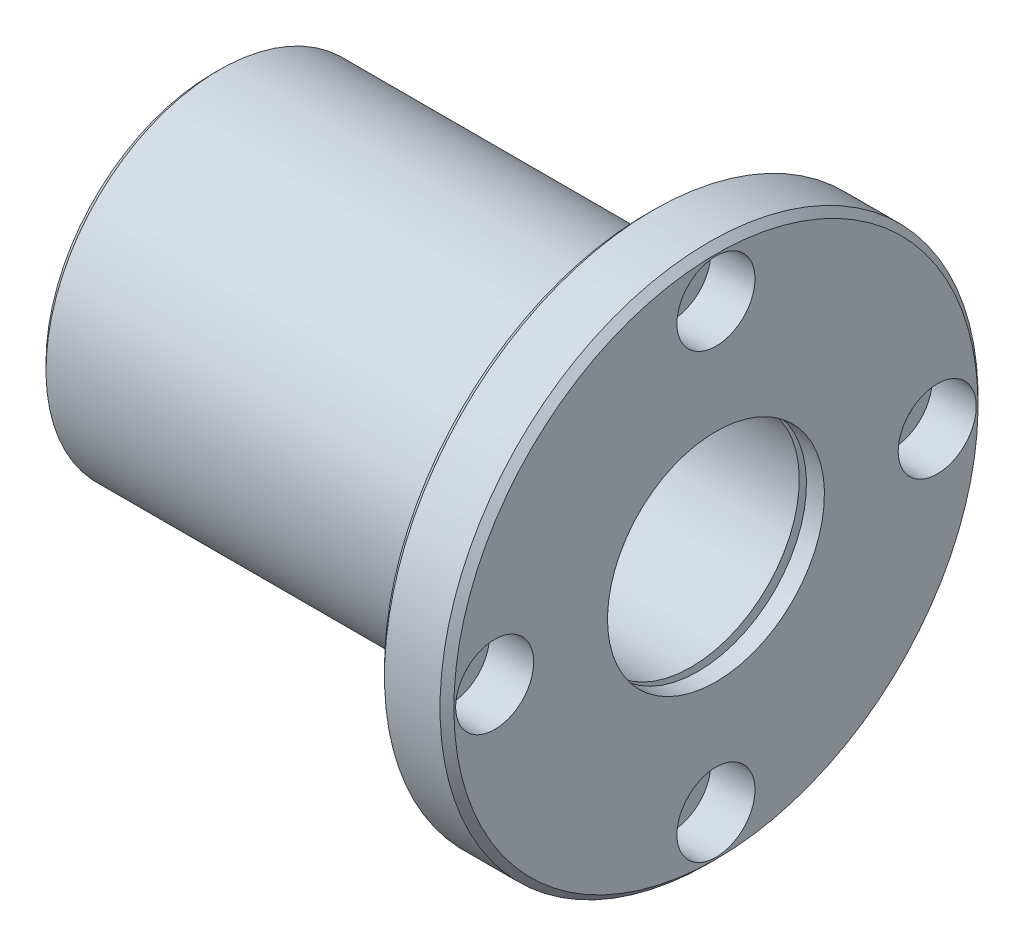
ISO-10303-21;
HEADER;
FILE_DESCRIPTION(('STEP AP214'),'2;1');
FILE_NAME('part.step','',(''),(''),'','','');
FILE_SCHEMA(('AUTOMOTIVE_DESIGN { 1 0 10303 214 1 1 1 1 }'));
ENDSEC;
DATA;
#1=APPLICATION_CONTEXT('core data for automotive mechanical design processes');
#2=APPLICATION_PROTOCOL_DEFINITION('international standard','automotive_design',2000,#1);
#3=PRODUCT_CONTEXT('',#1,'mechanical');
#4=PRODUCT('Part','Part','',(#3));
#5=PRODUCT_RELATED_PRODUCT_CATEGORY('part','',(#4));
#6=PRODUCT_DEFINITION_FORMATION('','',#4);
#7=PRODUCT_DEFINITION_CONTEXT('part definition',#1,'design');
#8=PRODUCT_DEFINITION('design','',#6,#7);
#9=PRODUCT_DEFINITION_SHAPE('','',#8);
#10=(LENGTH_UNIT() NAMED_UNIT(*) SI_UNIT(.MILLI.,.METRE.));
#11=(NAMED_UNIT(*) PLANE_ANGLE_UNIT() SI_UNIT($,.RADIAN.));
#12=(NAMED_UNIT(*) SI_UNIT($,.STERADIAN.) SOLID_ANGLE_UNIT());
#13=UNCERTAINTY_MEASURE_WITH_UNIT(LENGTH_MEASURE(1.E-05),#10,'distance_accuracy_value','');
#14=(GEOMETRIC_REPRESENTATION_CONTEXT(3) GLOBAL_UNCERTAINTY_ASSIGNED_CONTEXT((#13)) GLOBAL_UNIT_ASSIGNED_CONTEXT((#10,
#11,#12)) REPRESENTATION_CONTEXT('',''));
#15=CARTESIAN_POINT('',(0.,0.,0.));
#16=DIRECTION('',(0.,0.,1.));
#17=DIRECTION('',(1.,0.,0.));
#18=AXIS2_PLACEMENT_3D('',#15,#16,#17);
#19=CARTESIAN_POINT('',(0.,16.225,0.));
#20=DIRECTION('',(-1.,0.,0.));
#21=DIRECTION('',(0.,0.,1.));
#22=AXIS2_PLACEMENT_3D('',#19,#20,#21);
#23=PLANE('',#22);
#24=CARTESIAN_POINT('',(0.,0.,0.));
#25=DIRECTION('',(-1.,0.,0.));
#26=DIRECTION('',(0.,1.,0.));
#27=AXIS2_PLACEMENT_3D('',#24,#25,#26);
#28=CIRCLE('',#27,13.25);
#29=CARTESIAN_POINT('',(0.,-13.25,0.));
#30=VERTEX_POINT('',#29);
#31=EDGE_CURVE('E252',#30,#30,#28,.T.);
#32=ORIENTED_EDGE('',*,*,#31,.F.);
#33=EDGE_LOOP('',(#32));
#34=FACE_BOUND('',#33,.T.);
#35=CARTESIAN_POINT('',(0.,0.,0.));
#36=DIRECTION('',(-1.,0.,0.));
#37=DIRECTION('',(0.,1.,0.));
#38=AXIS2_PLACEMENT_3D('',#35,#36,#37);
#39=CIRCLE('',#38,19.2);
#40=CARTESIAN_POINT('',(0.,-19.2,0.));
#41=VERTEX_POINT('',#40);
#42=EDGE_CURVE('E245',#41,#41,#39,.T.);
#43=ORIENTED_EDGE('',*,*,#42,.T.);
#44=EDGE_LOOP('',(#43));
#45=FACE_BOUND('',#44,.T.);
#46=ADVANCED_FACE('F16',(#34,#45),#23,.T.);
#47=CARTESIAN_POINT('',(50.,25.175630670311,0.));
#48=DIRECTION('',(-1.,0.,0.));
#49=DIRECTION('',(0.,0.,1.));
#50=AXIS2_PLACEMENT_3D('',#47,#48,#49);
#51=PLANE('',#50);
#52=CARTESIAN_POINT('',(50.,0.,0.));
#53=DIRECTION('',(-1.,0.,0.));
#54=DIRECTION('',(0.,1.,0.));
#55=AXIS2_PLACEMENT_3D('',#52,#53,#54);
#56=CIRCLE('',#55,20.1512613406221);
#57=CARTESIAN_POINT('',(50.,20.1512613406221,0.));
#58=VERTEX_POINT('',#57);
#59=CARTESIAN_POINT('',(50.,0.,-20.1512613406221));
#60=VERTEX_POINT('',#59);
#61=EDGE_CURVE('E244',#58,#60,#56,.T.);
#62=ORIENTED_EDGE('',*,*,#61,.F.);
#63=CARTESIAN_POINT('',(50.,0.,0.));
#64=DIRECTION('',(-1.,0.,0.));
#65=DIRECTION('',(0.,1.,0.));
#66=AXIS2_PLACEMENT_3D('',#63,#64,#65);
#67=CIRCLE('',#66,20.1512613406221);
#68=EDGE_CURVE('E224',#60,#58,#67,.T.);
#69=ORIENTED_EDGE('',*,*,#68,.F.);
#70=EDGE_LOOP('',(#62,#69));
#71=FACE_BOUND('',#70,.T.);
#72=CARTESIAN_POINT('',(50.,25.5,0.));
#73=DIRECTION('',(1.,0.,0.));
#74=DIRECTION('',(0.,1.,0.));
#75=AXIS2_PLACEMENT_3D('',#72,#73,#74);
#76=CIRCLE('',#75,2.75);
#77=CARTESIAN_POINT('',(50.,22.75,0.));
#78=VERTEX_POINT('',#77);
#79=EDGE_CURVE('E234',#78,#78,#76,.T.);
#80=ORIENTED_EDGE('',*,*,#79,.T.);
#81=EDGE_LOOP('',(#80));
#82=FACE_BOUND('',#81,.T.);
#83=CARTESIAN_POINT('',(50.,-25.5,0.));
#84=DIRECTION('',(1.,0.,0.));
#85=DIRECTION('',(0.,1.,0.));
#86=AXIS2_PLACEMENT_3D('',#83,#84,#85);
#87=CIRCLE('',#86,2.75);
#88=CARTESIAN_POINT('',(50.,-28.25,0.));
#89=VERTEX_POINT('',#88);
#90=EDGE_CURVE('E303',#89,#89,#87,.T.);
#91=ORIENTED_EDGE('',*,*,#90,.T.);
#92=EDGE_LOOP('',(#91));
#93=FACE_BOUND('',#92,.T.);
#94=CARTESIAN_POINT('',(50.,0.,25.5));
#95=DIRECTION('',(1.,0.,0.));
#96=DIRECTION('',(0.,0.,-1.));
#97=AXIS2_PLACEMENT_3D('',#94,#95,#96);
#98=CIRCLE('',#97,2.75);
#99=CARTESIAN_POINT('',(50.,0.,28.25));
#100=VERTEX_POINT('',#99);
#101=EDGE_CURVE('E276',#100,#100,#98,.T.);
#102=ORIENTED_EDGE('',*,*,#101,.T.);
#103=EDGE_LOOP('',(#102));
#104=FACE_BOUND('',#103,.T.);
#105=CARTESIAN_POINT('',(50.,0.,-25.5));
#106=DIRECTION('',(1.,0.,0.));
#107=DIRECTION('',(0.,0.,-1.));
#108=AXIS2_PLACEMENT_3D('',#105,#106,#107);
#109=CIRCLE('',#108,2.75);
#110=CARTESIAN_POINT('',(50.,0.,-22.75));
#111=VERTEX_POINT('',#110);
#112=EDGE_CURVE('E355',#111,#111,#109,.T.);
#113=ORIENTED_EDGE('',*,*,#112,.T.);
#114=EDGE_LOOP('',(#113));
#115=FACE_BOUND('',#114,.T.);
#116=CARTESIAN_POINT('',(50.,0.,0.));
#117=DIRECTION('',(-1.,0.,0.));
#118=DIRECTION('',(0.,1.,0.));
#119=AXIS2_PLACEMENT_3D('',#116,#117,#118);
#120=CIRCLE('',#119,30.2);
#121=CARTESIAN_POINT('',(50.,-30.2,0.));
#122=VERTEX_POINT('',#121);
#123=EDGE_CURVE('E260',#122,#122,#120,.T.);
#124=ORIENTED_EDGE('',*,*,#123,.T.);
#125=EDGE_LOOP('',(#124));
#126=FACE_BOUND('',#125,.T.);
#127=ADVANCED_FACE('F18',(#71,#82,#93,#104,#115,#126),#51,.T.);
#128=CARTESIAN_POINT('',(58.,21.35,0.));
#129=DIRECTION('',(1.,0.,0.));
#130=DIRECTION('',(0.,1.,0.));
#131=AXIS2_PLACEMENT_3D('',#128,#129,#130);
#132=PLANE('',#131);
#133=CARTESIAN_POINT('',(58.,25.5,0.));
#134=DIRECTION('',(-1.,0.,0.));
#135=DIRECTION('',(0.,1.,0.));
#136=AXIS2_PLACEMENT_3D('',#133,#134,#135);
#137=CIRCLE('',#136,4.5);
#138=CARTESIAN_POINT('',(58.,21.,0.));
#139=VERTEX_POINT('',#138);
#140=EDGE_CURVE('E300',#139,#139,#137,.T.);
#141=ORIENTED_EDGE('',*,*,#140,.T.);
#142=EDGE_LOOP('',(#141));
#143=FACE_BOUND('',#142,.T.);
#144=CARTESIAN_POINT('',(58.,-25.5,0.));
#145=DIRECTION('',(-1.,0.,0.));
#146=DIRECTION('',(0.,1.,0.));
#147=AXIS2_PLACEMENT_3D('',#144,#145,#146);
#148=CIRCLE('',#147,4.5);
#149=CARTESIAN_POINT('',(58.,-30.,0.));
#150=VERTEX_POINT('',#149);
#151=EDGE_CURVE('E280',#150,#150,#148,.T.);
#152=ORIENTED_EDGE('',*,*,#151,.T.);
#153=EDGE_LOOP('',(#152));
#154=FACE_BOUND('',#153,.T.);
#155=CARTESIAN_POINT('',(58.,0.,25.5));
#156=DIRECTION('',(-1.,0.,0.));
#157=DIRECTION('',(0.,0.,-1.));
#158=AXIS2_PLACEMENT_3D('',#155,#156,#157);
#159=CIRCLE('',#158,4.5);
#160=CARTESIAN_POINT('',(58.,0.,30.));
#161=VERTEX_POINT('',#160);
#162=EDGE_CURVE('E352',#161,#161,#159,.T.);
#163=ORIENTED_EDGE('',*,*,#162,.T.);
#164=EDGE_LOOP('',(#163));
#165=FACE_BOUND('',#164,.T.);
#166=CARTESIAN_POINT('',(58.,0.,-25.5));
#167=DIRECTION('',(-1.,0.,0.));
#168=DIRECTION('',(0.,0.,-1.));
#169=AXIS2_PLACEMENT_3D('',#166,#167,#168);
#170=CIRCLE('',#169,4.5);
#171=CARTESIAN_POINT('',(58.,0.,-21.));
#172=VERTEX_POINT('',#171);
#173=EDGE_CURVE('E10',#172,#172,#170,.T.);
#174=ORIENTED_EDGE('',*,*,#173,.T.);
#175=EDGE_LOOP('',(#174));
#176=FACE_BOUND('',#175,.T.);
#177=CARTESIAN_POINT('',(58.,0.,0.));
#178=DIRECTION('',(-1.,0.,0.));
#179=DIRECTION('',(0.,1.,0.));
#180=AXIS2_PLACEMENT_3D('',#177,#178,#179);
#181=CIRCLE('',#180,12.5);
#182=CARTESIAN_POINT('',(58.,-12.5,0.));
#183=VERTEX_POINT('',#182);
#184=EDGE_CURVE('E210',#183,#183,#181,.T.);
#185=ORIENTED_EDGE('',*,*,#184,.T.);
#186=EDGE_LOOP('',(#185));
#187=FACE_BOUND('',#186,.T.);
#188=CARTESIAN_POINT('',(58.,0.,0.));
#189=DIRECTION('',(-1.,0.,0.));
#190=DIRECTION('',(0.,1.,0.));
#191=AXIS2_PLACEMENT_3D('',#188,#189,#190);
#192=CIRCLE('',#191,30.2);
#193=CARTESIAN_POINT('',(58.,-30.2,0.));
#194=VERTEX_POINT('',#193);
#195=EDGE_CURVE('E296',#194,#194,#192,.T.);
#196=ORIENTED_EDGE('',*,*,#195,.F.);
#197=EDGE_LOOP('',(#196));
#198=FACE_BOUND('',#197,.T.);
#199=ADVANCED_FACE('F418',(#143,#154,#165,#176,#187,#198),#132,.T.);
#200=CARTESIAN_POINT('',(55.9285714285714,13.5,0.));
#201=DIRECTION('',(-1.,0.,0.));
#202=DIRECTION('',(0.,0.,1.));
#203=AXIS2_PLACEMENT_3D('',#200,#201,#202);
#204=PLANE('',#203);
#205=CARTESIAN_POINT('',(55.9285714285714,0.,0.));
#206=DIRECTION('',(-1.,0.,0.));
#207=DIRECTION('',(0.,1.,0.));
#208=AXIS2_PLACEMENT_3D('',#205,#206,#207);
#209=CIRCLE('',#208,12.5);
#210=CARTESIAN_POINT('',(55.9285714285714,-12.5,0.));
#211=VERTEX_POINT('',#210);
#212=EDGE_CURVE('E299',#211,#211,#209,.T.);
#213=ORIENTED_EDGE('',*,*,#212,.F.);
#214=EDGE_LOOP('',(#213));
#215=FACE_BOUND('',#214,.T.);
#216=CARTESIAN_POINT('',(55.9285714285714,0.,0.));
#217=DIRECTION('',(-1.,0.,0.));
#218=DIRECTION('',(0.,1.,0.));
#219=AXIS2_PLACEMENT_3D('',#216,#217,#218);
#220=CIRCLE('',#219,14.5);
#221=CARTESIAN_POINT('',(55.9285714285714,-14.5,0.));
#222=VERTEX_POINT('',#221);
#223=EDGE_CURVE('E331',#222,#222,#220,.T.);
#224=ORIENTED_EDGE('',*,*,#223,.T.);
#225=EDGE_LOOP('',(#224));
#226=FACE_BOUND('',#225,.T.);
#227=ADVANCED_FACE('F464',(#215,#226),#204,.T.);
#228=CARTESIAN_POINT('',(55.1,13.5,0.));
#229=DIRECTION('',(1.,0.,0.));
#230=DIRECTION('',(0.,1.,0.));
#231=AXIS2_PLACEMENT_3D('',#228,#229,#230);
#232=PLANE('',#231);
#233=CARTESIAN_POINT('',(55.1,0.,0.));
#234=DIRECTION('',(-1.,0.,0.));
#235=DIRECTION('',(0.,1.,0.));
#236=AXIS2_PLACEMENT_3D('',#233,#234,#235);
#237=CIRCLE('',#236,12.5);
#238=CARTESIAN_POINT('',(55.1,-12.5,0.));
#239=VERTEX_POINT('',#238);
#240=EDGE_CURVE('E326',#239,#239,#237,.T.);
#241=ORIENTED_EDGE('',*,*,#240,.T.);
#242=EDGE_LOOP('',(#241));
#243=FACE_BOUND('',#242,.T.);
#244=CARTESIAN_POINT('',(55.1,0.,0.));
#245=DIRECTION('',(-1.,0.,0.));
#246=DIRECTION('',(0.,1.,0.));
#247=AXIS2_PLACEMENT_3D('',#244,#245,#246);
#248=CIRCLE('',#247,14.5);
#249=CARTESIAN_POINT('',(55.1,-14.5,0.));
#250=VERTEX_POINT('',#249);
#251=EDGE_CURVE('E314',#250,#250,#248,.T.);
#252=ORIENTED_EDGE('',*,*,#251,.F.);
#253=EDGE_LOOP('',(#252));
#254=FACE_BOUND('',#253,.T.);
#255=ADVANCED_FACE('F469',(#243,#254),#232,.T.);
#256=CARTESIAN_POINT('',(2.9,13.5,0.));
#257=DIRECTION('',(-1.,0.,0.));
#258=DIRECTION('',(0.,0.,1.));
#259=AXIS2_PLACEMENT_3D('',#256,#257,#258);
#260=PLANE('',#259);
#261=CARTESIAN_POINT('',(2.9,0.,0.));
#262=DIRECTION('',(-1.,0.,0.));
#263=DIRECTION('',(0.,1.,0.));
#264=AXIS2_PLACEMENT_3D('',#261,#262,#263);
#265=CIRCLE('',#264,12.5);
#266=CARTESIAN_POINT('',(2.9,-12.5,0.));
#267=VERTEX_POINT('',#266);
#268=EDGE_CURVE('E327',#267,#267,#265,.T.);
#269=ORIENTED_EDGE('',*,*,#268,.F.);
#270=EDGE_LOOP('',(#269));
#271=FACE_BOUND('',#270,.T.);
#272=CARTESIAN_POINT('',(2.9,0.,0.));
#273=DIRECTION('',(-1.,0.,0.));
#274=DIRECTION('',(0.,1.,0.));
#275=AXIS2_PLACEMENT_3D('',#272,#273,#274);
#276=CIRCLE('',#275,14.5);
#277=CARTESIAN_POINT('',(2.9,-14.5,0.));
#278=VERTEX_POINT('',#277);
#279=EDGE_CURVE('E249',#278,#278,#276,.T.);
#280=ORIENTED_EDGE('',*,*,#279,.T.);
#281=EDGE_LOOP('',(#280));
#282=FACE_BOUND('',#281,.T.);
#283=ADVANCED_FACE('F476',(#271,#282),#260,.T.);
#284=CARTESIAN_POINT('',(2.07142857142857,13.875,0.));
#285=DIRECTION('',(1.,0.,0.));
#286=DIRECTION('',(0.,1.,0.));
#287=AXIS2_PLACEMENT_3D('',#284,#285,#286);
#288=PLANE('',#287);
#289=CARTESIAN_POINT('',(2.07142857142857,0.,0.));
#290=DIRECTION('',(-1.,0.,0.));
#291=DIRECTION('',(0.,1.,0.));
#292=AXIS2_PLACEMENT_3D('',#289,#290,#291);
#293=CIRCLE('',#292,13.25);
#294=CARTESIAN_POINT('',(2.07142857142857,-13.25,0.));
#295=VERTEX_POINT('',#294);
#296=EDGE_CURVE('E231',#295,#295,#293,.T.);
#297=ORIENTED_EDGE('',*,*,#296,.T.);
#298=EDGE_LOOP('',(#297));
#299=FACE_BOUND('',#298,.T.);
#300=CARTESIAN_POINT('',(2.07142857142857,0.,0.));
#301=DIRECTION('',(-1.,0.,0.));
#302=DIRECTION('',(0.,1.,0.));
#303=AXIS2_PLACEMENT_3D('',#300,#301,#302);
#304=CIRCLE('',#303,14.5);
#305=CARTESIAN_POINT('',(2.07142857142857,-14.5,0.));
#306=VERTEX_POINT('',#305);
#307=EDGE_CURVE('E342',#306,#306,#304,.T.);
#308=ORIENTED_EDGE('',*,*,#307,.F.);
#309=EDGE_LOOP('',(#308));
#310=FACE_BOUND('',#309,.T.);
#311=ADVANCED_FACE('F478',(#299,#310),#288,.T.);
#312=CARTESIAN_POINT('',(52.9,29.125,0.));
#313=DIRECTION('',(-1.,0.,0.));
#314=DIRECTION('',(0.,0.,1.));
#315=AXIS2_PLACEMENT_3D('',#312,#313,#314);
#316=PLANE('',#315);
#317=CARTESIAN_POINT('',(52.9,25.5,0.));
#318=DIRECTION('',(-1.,0.,0.));
#319=DIRECTION('',(0.,1.,0.));
#320=AXIS2_PLACEMENT_3D('',#317,#318,#319);
#321=CIRCLE('',#320,2.75);
#322=CARTESIAN_POINT('',(52.9,22.75,0.));
#323=VERTEX_POINT('',#322);
#324=EDGE_CURVE('E230',#323,#323,#321,.T.);
#325=ORIENTED_EDGE('',*,*,#324,.T.);
#326=EDGE_LOOP('',(#325));
#327=FACE_BOUND('',#326,.T.);
#328=CARTESIAN_POINT('',(52.9,25.5,0.));
#329=DIRECTION('',(-1.,0.,0.));
#330=DIRECTION('',(0.,1.,0.));
#331=AXIS2_PLACEMENT_3D('',#328,#329,#330);
#332=CIRCLE('',#331,4.5);
#333=CARTESIAN_POINT('',(52.9,21.,0.));
#334=VERTEX_POINT('',#333);
#335=EDGE_CURVE('E225',#334,#334,#332,.T.);
#336=ORIENTED_EDGE('',*,*,#335,.F.);
#337=EDGE_LOOP('',(#336));
#338=FACE_BOUND('',#337,.T.);
#339=ADVANCED_FACE('F481',(#327,#338),#316,.F.);
#340=CARTESIAN_POINT('',(52.9,-21.875,0.));
#341=DIRECTION('',(-1.,0.,0.));
#342=DIRECTION('',(0.,0.,1.));
#343=AXIS2_PLACEMENT_3D('',#340,#341,#342);
#344=PLANE('',#343);
#345=CARTESIAN_POINT('',(52.9,-25.5,0.));
#346=DIRECTION('',(-1.,0.,0.));
#347=DIRECTION('',(0.,1.,0.));
#348=AXIS2_PLACEMENT_3D('',#345,#346,#347);
#349=CIRCLE('',#348,2.75);
#350=CARTESIAN_POINT('',(52.9,-28.25,0.));
#351=VERTEX_POINT('',#350);
#352=EDGE_CURVE('E221',#351,#351,#349,.T.);
#353=ORIENTED_EDGE('',*,*,#352,.T.);
#354=EDGE_LOOP('',(#353));
#355=FACE_BOUND('',#354,.T.);
#356=CARTESIAN_POINT('',(52.9,-25.5,0.));
#357=DIRECTION('',(-1.,0.,0.));
#358=DIRECTION('',(0.,1.,0.));
#359=AXIS2_PLACEMENT_3D('',#356,#357,#358);
#360=CIRCLE('',#359,4.5);
#361=CARTESIAN_POINT('',(52.9,-30.,0.));
#362=VERTEX_POINT('',#361);
#363=EDGE_CURVE('E216',#362,#362,#360,.T.);
#364=ORIENTED_EDGE('',*,*,#363,.F.);
#365=EDGE_LOOP('',(#364));
#366=FACE_BOUND('',#365,.T.);
#367=ADVANCED_FACE('F409',(#355,#366),#344,.F.);
#368=CARTESIAN_POINT('',(52.9,0.,21.875));
#369=DIRECTION('',(-1.,0.,0.));
#370=DIRECTION('',(0.,0.,1.));
#371=AXIS2_PLACEMENT_3D('',#368,#369,#370);
#372=PLANE('',#371);
#373=CARTESIAN_POINT('',(52.9,0.,25.5));
#374=DIRECTION('',(-1.,0.,0.));
#375=DIRECTION('',(0.,0.,-1.));
#376=AXIS2_PLACEMENT_3D('',#373,#374,#375);
#377=CIRCLE('',#376,2.75);
#378=CARTESIAN_POINT('',(52.9,0.,28.25));
#379=VERTEX_POINT('',#378);
#380=EDGE_CURVE('E264',#379,#379,#377,.T.);
#381=ORIENTED_EDGE('',*,*,#380,.T.);
#382=EDGE_LOOP('',(#381));
#383=FACE_BOUND('',#382,.T.);
#384=CARTESIAN_POINT('',(52.9,0.,25.5));
#385=DIRECTION('',(-1.,0.,0.));
#386=DIRECTION('',(0.,0.,-1.));
#387=AXIS2_PLACEMENT_3D('',#384,#385,#386);
#388=CIRCLE('',#387,4.5);
#389=CARTESIAN_POINT('',(52.9,0.,30.));
#390=VERTEX_POINT('',#389);
#391=EDGE_CURVE('E267',#390,#390,#388,.T.);
#392=ORIENTED_EDGE('',*,*,#391,.F.);
#393=EDGE_LOOP('',(#392));
#394=FACE_BOUND('',#393,.T.);
#395=ADVANCED_FACE('F399',(#383,#394),#372,.F.);
#396=CARTESIAN_POINT('',(52.9,0.,-29.125));
#397=DIRECTION('',(-1.,0.,0.));
#398=DIRECTION('',(0.,0.,1.));
#399=AXIS2_PLACEMENT_3D('',#396,#397,#398);
#400=PLANE('',#399);
#401=CARTESIAN_POINT('',(52.9,0.,-25.5));
#402=DIRECTION('',(-1.,0.,0.));
#403=DIRECTION('',(0.,0.,-1.));
#404=AXIS2_PLACEMENT_3D('',#401,#402,#403);
#405=CIRCLE('',#404,2.75);
#406=CARTESIAN_POINT('',(52.9,0.,-22.75));
#407=VERTEX_POINT('',#406);
#408=EDGE_CURVE('E363',#407,#407,#405,.T.);
#409=ORIENTED_EDGE('',*,*,#408,.T.);
#410=EDGE_LOOP('',(#409));
#411=FACE_BOUND('',#410,.T.);
#412=CARTESIAN_POINT('',(52.9,0.,-25.5));
#413=DIRECTION('',(-1.,0.,0.));
#414=DIRECTION('',(0.,0.,-1.));
#415=AXIS2_PLACEMENT_3D('',#412,#413,#414);
#416=CIRCLE('',#415,4.5);
#417=CARTESIAN_POINT('',(52.9,0.,-21.));
#418=VERTEX_POINT('',#417);
#419=EDGE_CURVE('E360',#418,#418,#416,.T.);
#420=ORIENTED_EDGE('',*,*,#419,.F.);
#421=EDGE_LOOP('',(#420));
#422=FACE_BOUND('',#421,.T.);
#423=ADVANCED_FACE('F397',(#411,#422),#400,.F.);
#424=CARTESIAN_POINT('',(55.45,0.,-25.5));
#425=DIRECTION('',(1.,0.,0.));
#426=DIRECTION('',(0.,0.,-1.));
#427=AXIS2_PLACEMENT_3D('',#424,#425,#426);
#428=CYLINDRICAL_SURFACE('',#427,4.5);
#429=ORIENTED_EDGE('',*,*,#419,.T.);
#430=DIRECTION('',(1.,0.,0.));
#431=VECTOR('',#430,1.);
#432=CARTESIAN_POINT('',(55.45,0.,-21.));
#433=LINE('',#432,#431);
#434=EDGE_CURVE('E25',#418,#172,#433,.T.);
#435=ORIENTED_EDGE('',*,*,#434,.T.);
#436=ORIENTED_EDGE('',*,*,#173,.F.);
#437=ORIENTED_EDGE('',*,*,#434,.F.);
#438=EDGE_LOOP('',(#429,#435,#436,#437));
#439=FACE_BOUND('',#438,.T.);
#440=ADVANCED_FACE('F394',(#439),#428,.F.);
#441=CARTESIAN_POINT('',(51.45,0.,-25.5));
#442=DIRECTION('',(1.,0.,0.));
#443=DIRECTION('',(0.,0.,-1.));
#444=AXIS2_PLACEMENT_3D('',#441,#442,#443);
#445=CYLINDRICAL_SURFACE('',#444,2.75);
#446=ORIENTED_EDGE('',*,*,#112,.F.);
#447=DIRECTION('',(1.,0.,0.));
#448=VECTOR('',#447,1.);
#449=CARTESIAN_POINT('',(51.45,0.,-22.75));
#450=LINE('',#449,#448);
#451=EDGE_CURVE('E386',#111,#407,#450,.T.);
#452=ORIENTED_EDGE('',*,*,#451,.T.);
#453=ORIENTED_EDGE('',*,*,#408,.F.);
#454=ORIENTED_EDGE('',*,*,#451,.F.);
#455=EDGE_LOOP('',(#446,#452,#453,#454));
#456=FACE_BOUND('',#455,.T.);
#457=ADVANCED_FACE('F407',(#456),#445,.F.);
#458=CARTESIAN_POINT('',(55.45,0.,25.5));
#459=DIRECTION('',(1.,0.,0.));
#460=DIRECTION('',(0.,0.,-1.));
#461=AXIS2_PLACEMENT_3D('',#458,#459,#460);
#462=CYLINDRICAL_SURFACE('',#461,4.5);
#463=ORIENTED_EDGE('',*,*,#391,.T.);
#464=DIRECTION('',(1.,0.,0.));
#465=VECTOR('',#464,1.);
#466=CARTESIAN_POINT('',(55.45,0.,30.));
#467=LINE('',#466,#465);
#468=EDGE_CURVE('E356',#390,#161,#467,.T.);
#469=ORIENTED_EDGE('',*,*,#468,.T.);
#470=ORIENTED_EDGE('',*,*,#162,.F.);
#471=ORIENTED_EDGE('',*,*,#468,.F.);
#472=EDGE_LOOP('',(#463,#469,#470,#471));
#473=FACE_BOUND('',#472,.T.);
#474=ADVANCED_FACE('F437',(#473),#462,.F.);
#475=CARTESIAN_POINT('',(51.45,0.,25.5));
#476=DIRECTION('',(1.,0.,0.));
#477=DIRECTION('',(0.,0.,-1.));
#478=AXIS2_PLACEMENT_3D('',#475,#476,#477);
#479=CYLINDRICAL_SURFACE('',#478,2.75);
#480=ORIENTED_EDGE('',*,*,#101,.F.);
#481=DIRECTION('',(1.,0.,0.));
#482=VECTOR('',#481,1.);
#483=CARTESIAN_POINT('',(51.45,0.,28.25));
#484=LINE('',#483,#482);
#485=EDGE_CURVE('E268',#100,#379,#484,.T.);
#486=ORIENTED_EDGE('',*,*,#485,.T.);
#487=ORIENTED_EDGE('',*,*,#380,.F.);
#488=ORIENTED_EDGE('',*,*,#485,.F.);
#489=EDGE_LOOP('',(#480,#486,#487,#488));
#490=FACE_BOUND('',#489,.T.);
#491=ADVANCED_FACE('F433',(#490),#479,.F.);
#492=CARTESIAN_POINT('',(55.45,-25.5,0.));
#493=DIRECTION('',(1.,0.,0.));
#494=DIRECTION('',(0.,1.,0.));
#495=AXIS2_PLACEMENT_3D('',#492,#493,#494);
#496=CYLINDRICAL_SURFACE('',#495,4.5);
#497=ORIENTED_EDGE('',*,*,#363,.T.);
#498=DIRECTION('',(1.,0.,0.));
#499=VECTOR('',#498,1.);
#500=CARTESIAN_POINT('',(55.45,-30.,0.));
#501=LINE('',#500,#499);
#502=EDGE_CURVE('E220',#362,#150,#501,.T.);
#503=ORIENTED_EDGE('',*,*,#502,.T.);
#504=ORIENTED_EDGE('',*,*,#151,.F.);
#505=ORIENTED_EDGE('',*,*,#502,.F.);
#506=EDGE_LOOP('',(#497,#503,#504,#505));
#507=FACE_BOUND('',#506,.T.);
#508=ADVANCED_FACE('F429',(#507),#496,.F.);
#509=CARTESIAN_POINT('',(51.45,-25.5,0.));
#510=DIRECTION('',(1.,0.,0.));
#511=DIRECTION('',(0.,1.,0.));
#512=AXIS2_PLACEMENT_3D('',#509,#510,#511);
#513=CYLINDRICAL_SURFACE('',#512,2.75);
#514=ORIENTED_EDGE('',*,*,#90,.F.);
#515=DIRECTION('',(1.,0.,0.));
#516=VECTOR('',#515,1.);
#517=CARTESIAN_POINT('',(51.45,-28.25,0.));
#518=LINE('',#517,#516);
#519=EDGE_CURVE('E283',#89,#351,#518,.T.);
#520=ORIENTED_EDGE('',*,*,#519,.T.);
#521=ORIENTED_EDGE('',*,*,#352,.F.);
#522=ORIENTED_EDGE('',*,*,#519,.F.);
#523=EDGE_LOOP('',(#514,#520,#521,#522));
#524=FACE_BOUND('',#523,.T.);
#525=ADVANCED_FACE('F426',(#524),#513,.F.);
#526=CARTESIAN_POINT('',(55.45,25.5,0.));
#527=DIRECTION('',(1.,0.,0.));
#528=DIRECTION('',(0.,1.,0.));
#529=AXIS2_PLACEMENT_3D('',#526,#527,#528);
#530=CYLINDRICAL_SURFACE('',#529,4.5);
#531=ORIENTED_EDGE('',*,*,#335,.T.);
#532=DIRECTION('',(1.,0.,0.));
#533=VECTOR('',#532,1.);
#534=CARTESIAN_POINT('',(55.45,21.,0.));
#535=LINE('',#534,#533);
#536=EDGE_CURVE('E229',#334,#139,#535,.T.);
#537=ORIENTED_EDGE('',*,*,#536,.T.);
#538=ORIENTED_EDGE('',*,*,#140,.F.);
#539=ORIENTED_EDGE('',*,*,#536,.F.);
#540=EDGE_LOOP('',(#531,#537,#538,#539));
#541=FACE_BOUND('',#540,.T.);
#542=ADVANCED_FACE('F424',(#541),#530,.F.);
#543=CARTESIAN_POINT('',(51.45,25.5,0.));
#544=DIRECTION('',(1.,0.,0.));
#545=DIRECTION('',(0.,1.,0.));
#546=AXIS2_PLACEMENT_3D('',#543,#544,#545);
#547=CYLINDRICAL_SURFACE('',#546,2.75);
#548=ORIENTED_EDGE('',*,*,#79,.F.);
#549=DIRECTION('',(1.,0.,0.));
#550=VECTOR('',#549,1.);
#551=CARTESIAN_POINT('',(51.45,22.75,0.));
#552=LINE('',#551,#550);
#553=EDGE_CURVE('E269',#78,#323,#552,.T.);
#554=ORIENTED_EDGE('',*,*,#553,.T.);
#555=ORIENTED_EDGE('',*,*,#324,.F.);
#556=ORIENTED_EDGE('',*,*,#553,.F.);
#557=EDGE_LOOP('',(#548,#554,#555,#556));
#558=FACE_BOUND('',#557,.T.);
#559=ADVANCED_FACE('F689',(#558),#547,.F.);
#560=CARTESIAN_POINT('',(1.03571428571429,0.,0.));
#561=DIRECTION('',(1.,0.,0.));
#562=DIRECTION('',(0.,1.,0.));
#563=AXIS2_PLACEMENT_3D('',#560,#561,#562);
#564=CYLINDRICAL_SURFACE('',#563,13.25);
#565=ORIENTED_EDGE('',*,*,#31,.T.);
#566=DIRECTION('',(1.,0.,0.));
#567=VECTOR('',#566,1.);
#568=CARTESIAN_POINT('',(1.03571428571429,-13.25,0.));
#569=LINE('',#568,#567);
#570=EDGE_CURVE('E235',#30,#295,#569,.T.);
#571=ORIENTED_EDGE('',*,*,#570,.T.);
#572=ORIENTED_EDGE('',*,*,#296,.F.);
#573=ORIENTED_EDGE('',*,*,#570,.F.);
#574=EDGE_LOOP('',(#565,#571,#572,#573));
#575=FACE_BOUND('',#574,.T.);
#576=ADVANCED_FACE('F694',(#575),#564,.F.);
#577=CARTESIAN_POINT('',(2.48571428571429,0.,0.));
#578=DIRECTION('',(1.,0.,0.));
#579=DIRECTION('',(0.,1.,0.));
#580=AXIS2_PLACEMENT_3D('',#577,#578,#579);
#581=CYLINDRICAL_SURFACE('',#580,14.5);
#582=ORIENTED_EDGE('',*,*,#307,.T.);
#583=DIRECTION('',(1.,0.,0.));
#584=VECTOR('',#583,1.);
#585=CARTESIAN_POINT('',(2.48571428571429,-14.5,0.));
#586=LINE('',#585,#584);
#587=EDGE_CURVE('E253',#306,#278,#586,.T.);
#588=ORIENTED_EDGE('',*,*,#587,.T.);
#589=ORIENTED_EDGE('',*,*,#279,.F.);
#590=ORIENTED_EDGE('',*,*,#587,.F.);
#591=EDGE_LOOP('',(#582,#588,#589,#590));
#592=FACE_BOUND('',#591,.T.);
#593=ADVANCED_FACE('F707',(#592),#581,.F.);
#594=CARTESIAN_POINT('',(29.,0.,0.));
#595=DIRECTION('',(1.,0.,0.));
#596=DIRECTION('',(0.,1.,0.));
#597=AXIS2_PLACEMENT_3D('',#594,#595,#596);
#598=CYLINDRICAL_SURFACE('',#597,12.5);
#599=ORIENTED_EDGE('',*,*,#268,.T.);
#600=DIRECTION('',(1.,0.,0.));
#601=VECTOR('',#600,1.);
#602=CARTESIAN_POINT('',(29.,-12.5,0.));
#603=LINE('',#602,#601);
#604=EDGE_CURVE('E322',#267,#239,#603,.T.);
#605=ORIENTED_EDGE('',*,*,#604,.T.);
#606=ORIENTED_EDGE('',*,*,#240,.F.);
#607=ORIENTED_EDGE('',*,*,#604,.F.);
#608=EDGE_LOOP('',(#599,#605,#606,#607));
#609=FACE_BOUND('',#608,.T.);
#610=ADVANCED_FACE('F771',(#609),#598,.F.);
#611=CARTESIAN_POINT('',(55.5142857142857,0.,0.));
#612=DIRECTION('',(1.,0.,0.));
#613=DIRECTION('',(0.,1.,0.));
#614=AXIS2_PLACEMENT_3D('',#611,#612,#613);
#615=CYLINDRICAL_SURFACE('',#614,14.5);
#616=ORIENTED_EDGE('',*,*,#251,.T.);
#617=DIRECTION('',(1.,0.,0.));
#618=VECTOR('',#617,1.);
#619=CARTESIAN_POINT('',(55.5142857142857,-14.5,0.));
#620=LINE('',#619,#618);
#621=EDGE_CURVE('E318',#250,#222,#620,.T.);
#622=ORIENTED_EDGE('',*,*,#621,.T.);
#623=ORIENTED_EDGE('',*,*,#223,.F.);
#624=ORIENTED_EDGE('',*,*,#621,.F.);
#625=EDGE_LOOP('',(#616,#622,#623,#624));
#626=FACE_BOUND('',#625,.T.);
#627=ADVANCED_FACE('F794',(#626),#615,.F.);
#628=CARTESIAN_POINT('',(56.9642857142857,0.,0.));
#629=DIRECTION('',(1.,0.,0.));
#630=DIRECTION('',(0.,1.,0.));
#631=AXIS2_PLACEMENT_3D('',#628,#629,#630);
#632=CYLINDRICAL_SURFACE('',#631,12.5);
#633=ORIENTED_EDGE('',*,*,#212,.T.);
#634=DIRECTION('',(1.,0.,0.));
#635=VECTOR('',#634,1.);
#636=CARTESIAN_POINT('',(56.9642857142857,-12.5,0.));
#637=LINE('',#636,#635);
#638=EDGE_CURVE('E307',#211,#183,#637,.T.);
#639=ORIENTED_EDGE('',*,*,#638,.T.);
#640=ORIENTED_EDGE('',*,*,#184,.F.);
#641=ORIENTED_EDGE('',*,*,#638,.F.);
#642=EDGE_LOOP('',(#633,#639,#640,#641));
#643=FACE_BOUND('',#642,.T.);
#644=ADVANCED_FACE('F783',(#643),#632,.F.);
#645=CARTESIAN_POINT('',(57.6,0.,0.));
#646=DIRECTION('',(-1.,0.,0.));
#647=DIRECTION('',(0.,1.,0.));
#648=AXIS2_PLACEMENT_3D('',#645,#646,#647);
#649=CONICAL_SURFACE('',#648,30.6,0.785398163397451);
#650=CARTESIAN_POINT('',(57.2,0.,0.));
#651=DIRECTION('',(-1.,0.,0.));
#652=DIRECTION('',(0.,1.,0.));
#653=AXIS2_PLACEMENT_3D('',#650,#651,#652);
#654=CIRCLE('',#653,31.);
#655=CARTESIAN_POINT('',(57.2,-31.,0.));
#656=VERTEX_POINT('',#655);
#657=EDGE_CURVE('E240',#656,#656,#654,.T.);
#658=ORIENTED_EDGE('',*,*,#657,.F.);
#659=DIRECTION('',(0.707106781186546,0.707106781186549,0.));
#660=VECTOR('',#659,1.);
#661=CARTESIAN_POINT('',(57.6,-30.6,0.));
#662=LINE('',#661,#660);
#663=EDGE_CURVE('E239',#656,#194,#662,.T.);
#664=ORIENTED_EDGE('',*,*,#663,.T.);
#665=ORIENTED_EDGE('',*,*,#195,.T.);
#666=ORIENTED_EDGE('',*,*,#663,.F.);
#667=EDGE_LOOP('',(#658,#664,#665,#666));
#668=FACE_BOUND('',#667,.T.);
#669=ADVANCED_FACE('F460',(#668),#649,.T.);
#670=CARTESIAN_POINT('',(54.,0.,0.));
#671=DIRECTION('',(1.,0.,0.));
#672=DIRECTION('',(0.,1.,0.));
#673=AXIS2_PLACEMENT_3D('',#670,#671,#672);
#674=CYLINDRICAL_SURFACE('',#673,31.);
#675=ORIENTED_EDGE('',*,*,#657,.T.);
#676=DIRECTION('',(-1.,0.,0.));
#677=VECTOR('',#676,1.);
#678=CARTESIAN_POINT('',(54.,-31.,0.));
#679=LINE('',#678,#677);
#680=CARTESIAN_POINT('',(50.8,-31.,0.));
#681=VERTEX_POINT('',#680);
#682=EDGE_CURVE('E236',#656,#681,#679,.T.);
#683=ORIENTED_EDGE('',*,*,#682,.T.);
#684=CARTESIAN_POINT('',(50.8,0.,0.));
#685=DIRECTION('',(-1.,0.,0.));
#686=DIRECTION('',(0.,1.,0.));
#687=AXIS2_PLACEMENT_3D('',#684,#685,#686);
#688=CIRCLE('',#687,31.);
#689=EDGE_CURVE('E193',#681,#681,#688,.T.);
#690=ORIENTED_EDGE('',*,*,#689,.F.);
#691=ORIENTED_EDGE('',*,*,#682,.F.);
#692=EDGE_LOOP('',(#675,#683,#690,#691));
#693=FACE_BOUND('',#692,.T.);
#694=ADVANCED_FACE('F457',(#693),#674,.T.);
#695=CARTESIAN_POINT('',(50.4,0.,0.));
#696=DIRECTION('',(1.,0.,0.));
#697=DIRECTION('',(0.,1.,0.));
#698=AXIS2_PLACEMENT_3D('',#695,#696,#697);
#699=CONICAL_SURFACE('',#698,30.6,0.785398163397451);
#700=ORIENTED_EDGE('',*,*,#689,.T.);
#701=DIRECTION('',(-0.707106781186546,0.707106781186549,0.));
#702=VECTOR('',#701,1.);
#703=CARTESIAN_POINT('',(50.4,-30.6,0.));
#704=LINE('',#703,#702);
#705=EDGE_CURVE('E215',#681,#122,#704,.T.);
#706=ORIENTED_EDGE('',*,*,#705,.T.);
#707=ORIENTED_EDGE('',*,*,#123,.F.);
#708=ORIENTED_EDGE('',*,*,#705,.F.);
#709=EDGE_LOOP('',(#700,#706,#707,#708));
#710=FACE_BOUND('',#709,.T.);
#711=ADVANCED_FACE('F453',(#710),#699,.T.);
#712=CARTESIAN_POINT('',(48.4243965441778,0.,0.));
#713=DIRECTION('',(-1.,0.,0.));
#714=DIRECTION('',(0.,1.,0.));
#715=AXIS2_PLACEMENT_3D('',#712,#713,#714);
#716=CONICAL_SURFACE('',#715,19.7853133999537,0.254758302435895);
#717=CARTESIAN_POINT('',(47.6,0.,0.));
#718=DIRECTION('',(-1.,0.,0.));
#719=DIRECTION('',(0.,1.,0.));
#720=AXIS2_PLACEMENT_3D('',#717,#718,#719);
#721=CIRCLE('',#720,20.);
#722=CARTESIAN_POINT('',(47.6,-20.,0.));
#723=VERTEX_POINT('',#722);
#724=EDGE_CURVE('E190',#723,#723,#721,.T.);
#725=ORIENTED_EDGE('',*,*,#724,.F.);
#726=DIRECTION('',(0.967724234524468,0.252011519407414,0.));
#727=VECTOR('',#726,1.);
#728=CARTESIAN_POINT('',(48.4243965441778,-19.7853133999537,0.));
#729=LINE('',#728,#727);
#730=CARTESIAN_POINT('',(49.2487930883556,-19.5706267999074,0.));
#731=VERTEX_POINT('',#730);
#732=EDGE_CURVE('E184',#723,#731,#729,.T.);
#733=ORIENTED_EDGE('',*,*,#732,.T.);
#734=CARTESIAN_POINT('',(49.2487930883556,0.,0.));
#735=DIRECTION('',(-1.,0.,0.));
#736=DIRECTION('',(0.,1.,0.));
#737=AXIS2_PLACEMENT_3D('',#734,#735,#736);
#738=CIRCLE('',#737,19.5706267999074);
#739=CARTESIAN_POINT('',(49.2487930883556,0.,-19.5706267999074));
#740=VERTEX_POINT('',#739);
#741=EDGE_CURVE('E188',#731,#740,#738,.T.);
#742=ORIENTED_EDGE('',*,*,#741,.T.);
#743=CARTESIAN_POINT('',(49.2487930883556,0.,0.));
#744=DIRECTION('',(-1.,0.,0.));
#745=DIRECTION('',(0.,1.,0.));
#746=AXIS2_PLACEMENT_3D('',#743,#744,#745);
#747=CIRCLE('',#746,19.5706267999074);
#748=EDGE_CURVE('E197',#740,#731,#747,.T.);
#749=ORIENTED_EDGE('',*,*,#748,.T.);
#750=ORIENTED_EDGE('',*,*,#732,.F.);
#751=EDGE_LOOP('',(#725,#733,#742,#749,#750));
#752=FACE_BOUND('',#751,.T.);
#753=ADVANCED_FACE('F186',(#752),#716,.T.);
#754=CARTESIAN_POINT('',(24.2,0.,0.));
#755=DIRECTION('',(1.,0.,0.));
#756=DIRECTION('',(0.,1.,0.));
#757=AXIS2_PLACEMENT_3D('',#754,#755,#756);
#758=CYLINDRICAL_SURFACE('',#757,20.);
#759=ORIENTED_EDGE('',*,*,#724,.T.);
#760=DIRECTION('',(-1.,0.,0.));
#761=VECTOR('',#760,1.);
#762=CARTESIAN_POINT('',(24.2,-20.,0.));
#763=LINE('',#762,#761);
#764=CARTESIAN_POINT('',(0.8,-20.,0.));
#765=VERTEX_POINT('',#764);
#766=EDGE_CURVE('E194',#723,#765,#763,.T.);
#767=ORIENTED_EDGE('',*,*,#766,.T.);
#768=CARTESIAN_POINT('',(0.8,0.,0.));
#769=DIRECTION('',(-1.,0.,0.));
#770=DIRECTION('',(0.,1.,0.));
#771=AXIS2_PLACEMENT_3D('',#768,#769,#770);
#772=CIRCLE('',#771,20.);
#773=EDGE_CURVE('E256',#765,#765,#772,.T.);
#774=ORIENTED_EDGE('',*,*,#773,.F.);
#775=ORIENTED_EDGE('',*,*,#766,.F.);
#776=EDGE_LOOP('',(#759,#767,#774,#775));
#777=FACE_BOUND('',#776,.T.);
#778=ADVANCED_FACE('F679',(#777),#758,.T.);
#779=CARTESIAN_POINT('',(0.4,0.,0.));
#780=DIRECTION('',(1.,0.,0.));
#781=DIRECTION('',(0.,1.,0.));
#782=AXIS2_PLACEMENT_3D('',#779,#780,#781);
#783=CONICAL_SURFACE('',#782,19.6,0.785398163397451);
#784=ORIENTED_EDGE('',*,*,#773,.T.);
#785=DIRECTION('',(-0.707106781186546,0.70710678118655,0.));
#786=VECTOR('',#785,1.);
#787=CARTESIAN_POINT('',(0.4,-19.6,0.));
#788=LINE('',#787,#786);
#789=EDGE_CURVE('E248',#765,#41,#788,.T.);
#790=ORIENTED_EDGE('',*,*,#789,.T.);
#791=ORIENTED_EDGE('',*,*,#42,.F.);
#792=ORIENTED_EDGE('',*,*,#789,.F.);
#793=EDGE_LOOP('',(#784,#790,#791,#792));
#794=FACE_BOUND('',#793,.T.);
#795=ADVANCED_FACE('F720',(#794),#783,.T.);
#796=CARTESIAN_POINT('',(49.4,0.,0.));
#797=DIRECTION('',(-1.,0.,0.));
#798=DIRECTION('',(0.,0.,1.));
#799=AXIS2_PLACEMENT_3D('',#796,#797,#798);
#800=TOROIDAL_SURFACE('',#799,20.1512613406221,0.6);
#801=ORIENTED_EDGE('',*,*,#741,.F.);
#802=ORIENTED_EDGE('',*,*,#748,.F.);
#803=CARTESIAN_POINT('',(49.4,0.,-20.1512613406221));
#804=DIRECTION('',(0.,1.,0.));
#805=DIRECTION('',(0.,0.,-1.));
#806=AXIS2_PLACEMENT_3D('',#803,#804,#805);
#807=CIRCLE('',#806,0.6);
#808=EDGE_CURVE('E201',#740,#60,#807,.T.);
#809=ORIENTED_EDGE('',*,*,#808,.T.);
#810=ORIENTED_EDGE('',*,*,#68,.T.);
#811=ORIENTED_EDGE('',*,*,#61,.T.);
#812=ORIENTED_EDGE('',*,*,#808,.F.);
#813=EDGE_LOOP('',(#801,#802,#809,#810,#811,#812));
#814=FACE_BOUND('',#813,.T.);
#815=ADVANCED_FACE('F203',(#814),#800,.F.);
#816=CLOSED_SHELL('',(#46,#127,#199,#227,#255,#283,#311,#339,#367,#395,#423,#440,#457,#474,#491,
#508,#525,#542,#559,#576,#593,#610,#627,#644,#669,#694,#711,#753,#778,#795,#815));
#817=MANIFOLD_SOLID_BREP('B1',#816);
#818=ADVANCED_BREP_SHAPE_REPRESENTATION('',(#18,#817),#14);
#819=SHAPE_DEFINITION_REPRESENTATION(#9,#818);
ENDSEC;
END-ISO-10303-21;
